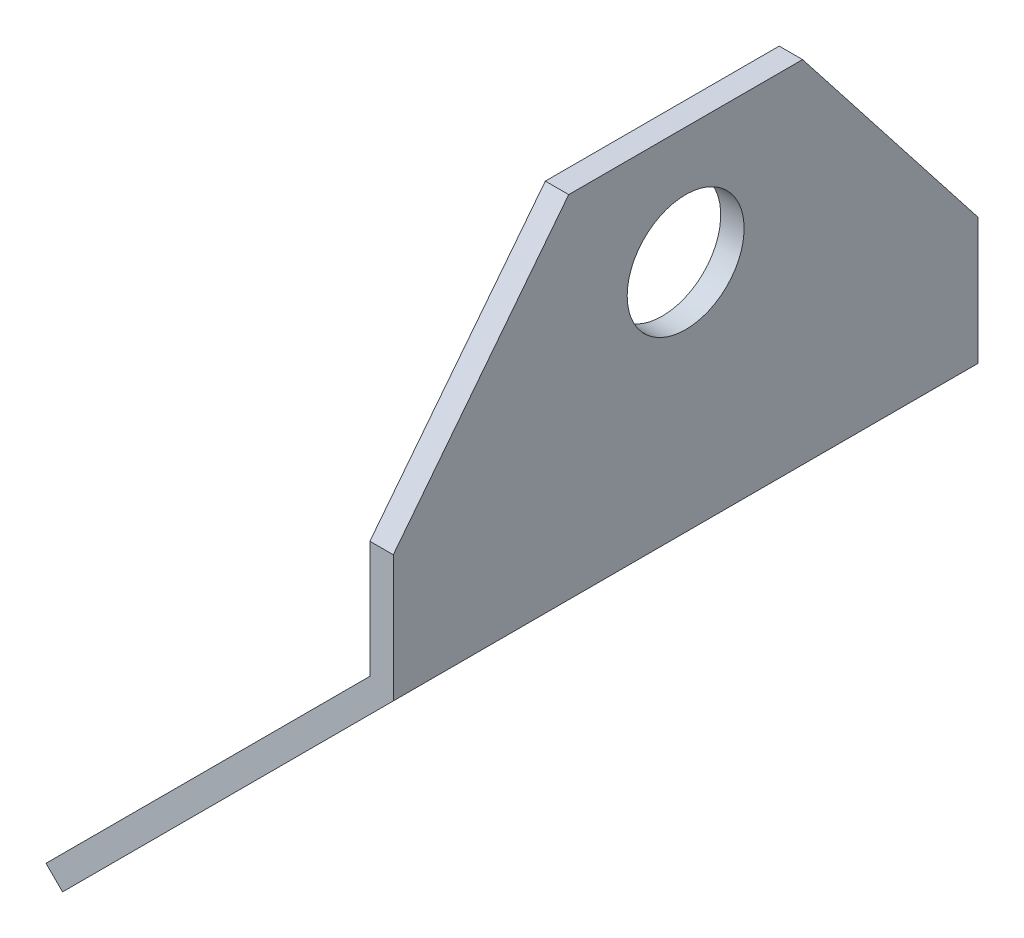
ISO-10303-21;
HEADER;
FILE_DESCRIPTION(('STEP AP214'),'2;1');
FILE_NAME('part.step','',(''),(''),'','','');
FILE_SCHEMA(('AUTOMOTIVE_DESIGN { 1 0 10303 214 1 1 1 1 }'));
ENDSEC;
DATA;
#1=APPLICATION_CONTEXT('core data for automotive mechanical design processes');
#2=APPLICATION_PROTOCOL_DEFINITION('international standard','automotive_design',2000,#1);
#3=PRODUCT_CONTEXT('',#1,'mechanical');
#4=PRODUCT('Part','Part','',(#3));
#5=PRODUCT_RELATED_PRODUCT_CATEGORY('part','',(#4));
#6=PRODUCT_DEFINITION_FORMATION('','',#4);
#7=PRODUCT_DEFINITION_CONTEXT('part definition',#1,'design');
#8=PRODUCT_DEFINITION('design','',#6,#7);
#9=PRODUCT_DEFINITION_SHAPE('','',#8);
#10=(LENGTH_UNIT() NAMED_UNIT(*) SI_UNIT(.MILLI.,.METRE.));
#11=(NAMED_UNIT(*) PLANE_ANGLE_UNIT() SI_UNIT($,.RADIAN.));
#12=(NAMED_UNIT(*) SI_UNIT($,.STERADIAN.) SOLID_ANGLE_UNIT());
#13=UNCERTAINTY_MEASURE_WITH_UNIT(LENGTH_MEASURE(1.E-05),#10,'distance_accuracy_value','');
#14=(GEOMETRIC_REPRESENTATION_CONTEXT(3) GLOBAL_UNCERTAINTY_ASSIGNED_CONTEXT((#13)) GLOBAL_UNIT_ASSIGNED_CONTEXT((#10,
#11,#12)) REPRESENTATION_CONTEXT('',''));
#15=CARTESIAN_POINT('',(0.,0.,0.));
#16=DIRECTION('',(0.,0.,1.));
#17=DIRECTION('',(1.,0.,0.));
#18=AXIS2_PLACEMENT_3D('',#15,#16,#17);
#19=CARTESIAN_POINT('',(0.,0.,50.0000000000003));
#20=DIRECTION('',(1.,0.,0.));
#21=DIRECTION('',(0.,0.,-1.));
#22=AXIS2_PLACEMENT_3D('',#19,#20,#21);
#23=PLANE('',#22);
#24=CARTESIAN_POINT('',(0.,20.,25.0000000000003));
#25=DIRECTION('',(1.,0.,0.));
#26=DIRECTION('',(0.,0.,-1.));
#27=AXIS2_PLACEMENT_3D('',#24,#25,#26);
#28=CIRCLE('',#27,5.);
#29=CARTESIAN_POINT('',(0.,20.,30.0000000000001));
#30=VERTEX_POINT('',#29);
#31=EDGE_CURVE('E179',#30,#30,#28,.T.);
#32=ORIENTED_EDGE('',*,*,#31,.F.);
#33=EDGE_LOOP('',(#32));
#34=FACE_BOUND('',#33,.T.);
#35=DIRECTION('',(0.,-1.,0.));
#36=VECTOR('',#35,1.);
#37=CARTESIAN_POINT('',(0.,0.,0.));
#38=LINE('',#37,#36);
#39=CARTESIAN_POINT('',(0.,10.8284271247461,1.94289029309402E-13));
#40=VERTEX_POINT('',#39);
#41=CARTESIAN_POINT('',(0.,0.,0.));
#42=VERTEX_POINT('',#41);
#43=EDGE_CURVE('E155',#40,#42,#38,.T.);
#44=ORIENTED_EDGE('',*,*,#43,.F.);
#45=DIRECTION('',(0.,-0.787581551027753,-0.616210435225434));
#46=VECTOR('',#45,1.);
#47=CARTESIAN_POINT('',(0.,29.9999999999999,15.0000000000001));
#48=LINE('',#47,#46);
#49=CARTESIAN_POINT('',(0.,29.9999999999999,15.0000000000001));
#50=VERTEX_POINT('',#49);
#51=EDGE_CURVE('E62',#50,#40,#48,.T.);
#52=ORIENTED_EDGE('',*,*,#51,.F.);
#53=DIRECTION('',(0.,0.,-1.));
#54=VECTOR('',#53,1.);
#55=CARTESIAN_POINT('',(0.,29.9999999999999,50.0000000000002));
#56=LINE('',#55,#54);
#57=CARTESIAN_POINT('',(0.,29.9999999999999,35.0000000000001));
#58=VERTEX_POINT('',#57);
#59=EDGE_CURVE('E117',#58,#50,#56,.T.);
#60=ORIENTED_EDGE('',*,*,#59,.F.);
#61=DIRECTION('',(0.,-0.787581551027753,0.616210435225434));
#62=VECTOR('',#61,1.);
#63=CARTESIAN_POINT('',(0.,29.9999999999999,35.0000000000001));
#64=LINE('',#63,#62);
#65=CARTESIAN_POINT('',(0.,10.8284271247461,50.0000000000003));
#66=VERTEX_POINT('',#65);
#67=EDGE_CURVE('E178',#58,#66,#64,.T.);
#68=ORIENTED_EDGE('',*,*,#67,.T.);
#69=DIRECTION('',(0.,-1.,0.));
#70=VECTOR('',#69,1.);
#71=CARTESIAN_POINT('',(0.,0.,50.0000000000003));
#72=LINE('',#71,#70);
#73=CARTESIAN_POINT('',(0.,0.,50.0000000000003));
#74=VERTEX_POINT('',#73);
#75=EDGE_CURVE('E171',#66,#74,#72,.T.);
#76=ORIENTED_EDGE('',*,*,#75,.T.);
#77=DIRECTION('',(0.,0.,-1.));
#78=VECTOR('',#77,1.);
#79=CARTESIAN_POINT('',(0.,0.,50.0000000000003));
#80=LINE('',#79,#78);
#81=EDGE_CURVE('E123',#74,#42,#80,.T.);
#82=ORIENTED_EDGE('',*,*,#81,.T.);
#83=EDGE_LOOP('',(#44,#52,#60,#68,#76,#82));
#84=FACE_BOUND('',#83,.T.);
#85=ADVANCED_FACE('F39',(#34,#84),#23,.T.);
#86=CARTESIAN_POINT('',(-2.00000000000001,30.,50.0000000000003));
#87=DIRECTION('',(0.,1.,0.));
#88=DIRECTION('',(0.,0.,1.));
#89=AXIS2_PLACEMENT_3D('',#86,#87,#88);
#90=PLANE('',#89);
#91=ORIENTED_EDGE('',*,*,#59,.T.);
#92=DIRECTION('',(1.,0.,0.));
#93=VECTOR('',#92,1.);
#94=CARTESIAN_POINT('',(0.001000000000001,29.9999999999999,14.9999999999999));
#95=LINE('',#94,#93);
#96=CARTESIAN_POINT('',(-1.99999999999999,29.9999999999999,15.0000000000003));
#97=VERTEX_POINT('',#96);
#98=EDGE_CURVE('E104',#97,#50,#95,.T.);
#99=ORIENTED_EDGE('',*,*,#98,.F.);
#100=DIRECTION('',(0.,0.,-1.));
#101=VECTOR('',#100,1.);
#102=CARTESIAN_POINT('',(-2.00000000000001,30.,50.0000000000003));
#103=LINE('',#102,#101);
#104=CARTESIAN_POINT('',(-2.,29.9999999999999,35.0000000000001));
#105=VERTEX_POINT('',#104);
#106=EDGE_CURVE('E115',#105,#97,#103,.T.);
#107=ORIENTED_EDGE('',*,*,#106,.F.);
#108=DIRECTION('',(1.,0.,0.));
#109=VECTOR('',#108,1.);
#110=CARTESIAN_POINT('',(0.00100000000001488,29.9999999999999,35.0000000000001));
#111=LINE('',#110,#109);
#112=EDGE_CURVE('E180',#105,#58,#111,.T.);
#113=ORIENTED_EDGE('',*,*,#112,.T.);
#114=EDGE_LOOP('',(#91,#99,#107,#113));
#115=FACE_BOUND('',#114,.T.);
#116=ADVANCED_FACE('F113',(#115),#90,.T.);
#117=CARTESIAN_POINT('',(-1.99999999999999,0.,50.0000000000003));
#118=DIRECTION('',(1.,0.,0.));
#119=DIRECTION('',(0.,0.,-1.));
#120=AXIS2_PLACEMENT_3D('',#117,#118,#119);
#121=PLANE('',#120);
#122=CARTESIAN_POINT('',(-1.99999999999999,20.,25.0000000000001));
#123=DIRECTION('',(-1.,0.,0.));
#124=DIRECTION('',(0.,0.,1.));
#125=AXIS2_PLACEMENT_3D('',#122,#123,#124);
#126=CIRCLE('',#125,5.);
#127=CARTESIAN_POINT('',(-1.99999999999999,20.,30.0000000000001));
#128=VERTEX_POINT('',#127);
#129=EDGE_CURVE('E224',#128,#128,#126,.T.);
#130=ORIENTED_EDGE('',*,*,#129,.F.);
#131=EDGE_LOOP('',(#130));
#132=FACE_BOUND('',#131,.T.);
#133=DIRECTION('',(0.,-0.787581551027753,-0.616210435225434));
#134=VECTOR('',#133,1.);
#135=CARTESIAN_POINT('',(-1.99999999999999,29.9999999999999,15.0000000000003));
#136=LINE('',#135,#134);
#137=CARTESIAN_POINT('',(-2.,10.8284271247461,0.));
#138=VERTEX_POINT('',#137);
#139=EDGE_CURVE('E101',#97,#138,#136,.T.);
#140=ORIENTED_EDGE('',*,*,#139,.T.);
#141=DIRECTION('',(0.,1.,0.));
#142=VECTOR('',#141,1.);
#143=CARTESIAN_POINT('',(-1.99999999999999,0.,1.94289029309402E-13));
#144=LINE('',#143,#142);
#145=CARTESIAN_POINT('',(-1.99999999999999,0.828427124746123,2.22044604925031E-13));
#146=VERTEX_POINT('',#145);
#147=EDGE_CURVE('E157',#138,#146,#144,.F.);
#148=ORIENTED_EDGE('',*,*,#147,.T.);
#149=DIRECTION('',(0.,0.,-1.));
#150=VECTOR('',#149,1.);
#151=CARTESIAN_POINT('',(-2.00000000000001,0.828427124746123,50.0000000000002));
#152=LINE('',#151,#150);
#153=CARTESIAN_POINT('',(-2.00000000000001,0.828427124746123,50.0000000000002));
#154=VERTEX_POINT('',#153);
#155=EDGE_CURVE('E121',#154,#146,#152,.T.);
#156=ORIENTED_EDGE('',*,*,#155,.F.);
#157=DIRECTION('',(0.,1.,0.));
#158=VECTOR('',#157,1.);
#159=CARTESIAN_POINT('',(-1.99999999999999,0.,50.0000000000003));
#160=LINE('',#159,#158);
#161=CARTESIAN_POINT('',(-1.99999999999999,10.8284271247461,50.));
#162=VERTEX_POINT('',#161);
#163=EDGE_CURVE('E126',#162,#154,#160,.F.);
#164=ORIENTED_EDGE('',*,*,#163,.F.);
#165=DIRECTION('',(0.,-0.787581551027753,0.616210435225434));
#166=VECTOR('',#165,1.);
#167=CARTESIAN_POINT('',(-2.,29.9999999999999,35.0000000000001));
#168=LINE('',#167,#166);
#169=EDGE_CURVE('E54',#105,#162,#168,.T.);
#170=ORIENTED_EDGE('',*,*,#169,.F.);
#171=ORIENTED_EDGE('',*,*,#106,.T.);
#172=EDGE_LOOP('',(#140,#148,#156,#164,#170,#171));
#173=FACE_BOUND('',#172,.T.);
#174=ADVANCED_FACE('F119',(#132,#173),#121,.F.);
#175=CARTESIAN_POINT('',(0.,0.,0.));
#176=DIRECTION('',(0.,0.,-1.));
#177=DIRECTION('',(-1.,0.,0.));
#178=AXIS2_PLACEMENT_3D('',#175,#176,#177);
#179=PLANE('',#178);
#180=ORIENTED_EDGE('',*,*,#147,.F.);
#181=DIRECTION('',(-1.,0.,0.));
#182=VECTOR('',#181,1.);
#183=CARTESIAN_POINT('',(0.001000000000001,10.8284271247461,0.));
#184=LINE('',#183,#182);
#185=EDGE_CURVE('E105',#40,#138,#184,.T.);
#186=ORIENTED_EDGE('',*,*,#185,.F.);
#187=ORIENTED_EDGE('',*,*,#43,.T.);
#188=DIRECTION('',(-0.707106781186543,-0.707106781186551,0.));
#189=VECTOR('',#188,1.);
#190=CARTESIAN_POINT('',(0.,0.,0.));
#191=LINE('',#190,#189);
#192=CARTESIAN_POINT('',(-28.2842712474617,-28.2842712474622,1.94289029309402E-13));
#193=VERTEX_POINT('',#192);
#194=EDGE_CURVE('E138',#42,#193,#191,.T.);
#195=ORIENTED_EDGE('',*,*,#194,.T.);
#196=DIRECTION('',(-0.707106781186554,0.707106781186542,0.));
#197=VECTOR('',#196,1.);
#198=CARTESIAN_POINT('',(-28.2842712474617,-28.2842712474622,1.94289029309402E-13));
#199=LINE('',#198,#197);
#200=CARTESIAN_POINT('',(-29.6984848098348,-26.870057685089,1.94289029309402E-13));
#201=VERTEX_POINT('',#200);
#202=EDGE_CURVE('E145',#193,#201,#199,.T.);
#203=ORIENTED_EDGE('',*,*,#202,.T.);
#204=DIRECTION('',(-0.707106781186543,-0.707106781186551,0.));
#205=VECTOR('',#204,1.);
#206=CARTESIAN_POINT('',(-1.41421356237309,1.41421356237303,1.94289029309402E-13));
#207=LINE('',#206,#205);
#208=EDGE_CURVE('E151',#146,#201,#207,.T.);
#209=ORIENTED_EDGE('',*,*,#208,.F.);
#210=EDGE_LOOP('',(#180,#186,#187,#195,#203,#209));
#211=FACE_BOUND('',#210,.T.);
#212=ADVANCED_FACE('F153',(#211),#179,.T.);
#213=CARTESIAN_POINT('',(-1.4142135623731,1.41421356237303,50.));
#214=DIRECTION('',(0.707106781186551,-0.707106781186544,0.));
#215=DIRECTION('',(0.707106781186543,0.707106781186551,0.));
#216=AXIS2_PLACEMENT_3D('',#213,#214,#215);
#217=PLANE('',#216);
#218=CARTESIAN_POINT('',(-15.556349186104,-12.727922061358,12.5400000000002));
#219=DIRECTION('',(-0.707106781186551,0.707106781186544,0.));
#220=DIRECTION('',(-0.707106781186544,-0.707106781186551,0.));
#221=AXIS2_PLACEMENT_3D('',#218,#219,#220);
#222=CIRCLE('',#221,4.);
#223=CARTESIAN_POINT('',(-18.3847763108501,-15.5563491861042,12.5400000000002));
#224=VERTEX_POINT('',#223);
#225=EDGE_CURVE('E227',#224,#224,#222,.T.);
#226=ORIENTED_EDGE('',*,*,#225,.F.);
#227=EDGE_LOOP('',(#226));
#228=FACE_BOUND('',#227,.T.);
#229=CARTESIAN_POINT('',(-15.556349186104,-12.727922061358,37.4600000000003));
#230=DIRECTION('',(-0.707106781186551,0.707106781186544,0.));
#231=DIRECTION('',(-0.707106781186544,-0.707106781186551,0.));
#232=AXIS2_PLACEMENT_3D('',#229,#230,#231);
#233=CIRCLE('',#232,4.);
#234=CARTESIAN_POINT('',(-18.3847763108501,-15.5563491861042,37.4600000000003));
#235=VERTEX_POINT('',#234);
#236=EDGE_CURVE('E218',#235,#235,#233,.T.);
#237=ORIENTED_EDGE('',*,*,#236,.F.);
#238=EDGE_LOOP('',(#237));
#239=FACE_BOUND('',#238,.T.);
#240=ORIENTED_EDGE('',*,*,#208,.T.);
#241=DIRECTION('',(0.,0.,-1.));
#242=VECTOR('',#241,1.);
#243=CARTESIAN_POINT('',(-29.6984848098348,-26.870057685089,50.0000000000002));
#244=LINE('',#243,#242);
#245=CARTESIAN_POINT('',(-29.6984848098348,-26.870057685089,50.0000000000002));
#246=VERTEX_POINT('',#245);
#247=EDGE_CURVE('E11',#246,#201,#244,.T.);
#248=ORIENTED_EDGE('',*,*,#247,.F.);
#249=DIRECTION('',(-0.707106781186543,-0.707106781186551,0.));
#250=VECTOR('',#249,1.);
#251=CARTESIAN_POINT('',(-1.4142135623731,1.41421356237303,50.));
#252=LINE('',#251,#250);
#253=EDGE_CURVE('E160',#154,#246,#252,.T.);
#254=ORIENTED_EDGE('',*,*,#253,.F.);
#255=ORIENTED_EDGE('',*,*,#155,.T.);
#256=EDGE_LOOP('',(#240,#248,#254,#255));
#257=FACE_BOUND('',#256,.T.);
#258=ADVANCED_FACE('F41',(#228,#239,#257),#217,.F.);
#259=CARTESIAN_POINT('',(-28.2842712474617,-28.2842712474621,50.));
#260=DIRECTION('',(-0.707106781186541,-0.707106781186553,0.));
#261=DIRECTION('',(0.707106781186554,-0.707106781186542,0.));
#262=AXIS2_PLACEMENT_3D('',#259,#260,#261);
#263=PLANE('',#262);
#264=ORIENTED_EDGE('',*,*,#202,.F.);
#265=DIRECTION('',(0.,0.,-1.));
#266=VECTOR('',#265,1.);
#267=CARTESIAN_POINT('',(-28.2842712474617,-28.2842712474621,50.));
#268=LINE('',#267,#266);
#269=CARTESIAN_POINT('',(-28.2842712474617,-28.2842712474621,50.));
#270=VERTEX_POINT('',#269);
#271=EDGE_CURVE('E47',#270,#193,#268,.T.);
#272=ORIENTED_EDGE('',*,*,#271,.F.);
#273=DIRECTION('',(-0.707106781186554,0.707106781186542,0.));
#274=VECTOR('',#273,1.);
#275=CARTESIAN_POINT('',(-28.2842712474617,-28.2842712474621,50.));
#276=LINE('',#275,#274);
#277=EDGE_CURVE('E162',#270,#246,#276,.T.);
#278=ORIENTED_EDGE('',*,*,#277,.T.);
#279=ORIENTED_EDGE('',*,*,#247,.T.);
#280=EDGE_LOOP('',(#264,#272,#278,#279));
#281=FACE_BOUND('',#280,.T.);
#282=ADVANCED_FACE('F146',(#281),#263,.T.);
#283=CARTESIAN_POINT('',(0.,0.,50.0000000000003));
#284=DIRECTION('',(0.707106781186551,-0.707106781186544,0.));
#285=DIRECTION('',(0.707106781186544,0.707106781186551,0.));
#286=AXIS2_PLACEMENT_3D('',#283,#284,#285);
#287=PLANE('',#286);
#288=CARTESIAN_POINT('',(-14.1421356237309,-14.1421356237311,12.54));
#289=DIRECTION('',(0.707106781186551,-0.707106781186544,0.));
#290=DIRECTION('',(0.707106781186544,0.707106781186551,0.));
#291=AXIS2_PLACEMENT_3D('',#288,#289,#290);
#292=CIRCLE('',#291,4.);
#293=CARTESIAN_POINT('',(-11.3137084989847,-11.3137084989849,12.54));
#294=VERTEX_POINT('',#293);
#295=EDGE_CURVE('E213',#294,#294,#292,.F.);
#296=ORIENTED_EDGE('',*,*,#295,.T.);
#297=EDGE_LOOP('',(#296));
#298=FACE_BOUND('',#297,.T.);
#299=CARTESIAN_POINT('',(-14.1421356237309,-14.142135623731,37.4600000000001));
#300=DIRECTION('',(0.707106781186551,-0.707106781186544,0.));
#301=DIRECTION('',(0.707106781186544,0.707106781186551,0.));
#302=AXIS2_PLACEMENT_3D('',#299,#300,#301);
#303=CIRCLE('',#302,4.);
#304=CARTESIAN_POINT('',(-11.3137084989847,-11.3137084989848,37.4600000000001));
#305=VERTEX_POINT('',#304);
#306=EDGE_CURVE('E216',#305,#305,#303,.F.);
#307=ORIENTED_EDGE('',*,*,#306,.T.);
#308=EDGE_LOOP('',(#307));
#309=FACE_BOUND('',#308,.T.);
#310=ORIENTED_EDGE('',*,*,#194,.F.);
#311=ORIENTED_EDGE('',*,*,#81,.F.);
#312=DIRECTION('',(-0.707106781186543,-0.707106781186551,0.));
#313=VECTOR('',#312,1.);
#314=CARTESIAN_POINT('',(0.,0.,50.0000000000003));
#315=LINE('',#314,#313);
#316=EDGE_CURVE('E140',#74,#270,#315,.T.);
#317=ORIENTED_EDGE('',*,*,#316,.T.);
#318=ORIENTED_EDGE('',*,*,#271,.T.);
#319=EDGE_LOOP('',(#310,#311,#317,#318));
#320=FACE_BOUND('',#319,.T.);
#321=ADVANCED_FACE('F135',(#298,#309,#320),#287,.T.);
#322=CARTESIAN_POINT('',(0.,0.,50.0000000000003));
#323=DIRECTION('',(0.,0.,-1.));
#324=DIRECTION('',(-1.,0.,0.));
#325=AXIS2_PLACEMENT_3D('',#322,#323,#324);
#326=PLANE('',#325);
#327=ORIENTED_EDGE('',*,*,#75,.F.);
#328=DIRECTION('',(1.,0.,0.));
#329=VECTOR('',#328,1.);
#330=CARTESIAN_POINT('',(0.001000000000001,10.8284271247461,50.));
#331=LINE('',#330,#329);
#332=EDGE_CURVE('E176',#162,#66,#331,.T.);
#333=ORIENTED_EDGE('',*,*,#332,.F.);
#334=ORIENTED_EDGE('',*,*,#163,.T.);
#335=ORIENTED_EDGE('',*,*,#253,.T.);
#336=ORIENTED_EDGE('',*,*,#277,.F.);
#337=ORIENTED_EDGE('',*,*,#316,.F.);
#338=EDGE_LOOP('',(#327,#333,#334,#335,#336,#337));
#339=FACE_BOUND('',#338,.T.);
#340=ADVANCED_FACE('F184',(#339),#326,.F.);
#341=CARTESIAN_POINT('',(0.001000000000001,29.9999999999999,14.9999999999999));
#342=DIRECTION('',(0.,0.616210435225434,-0.787581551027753));
#343=DIRECTION('',(0.,0.787581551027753,0.616210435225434));
#344=AXIS2_PLACEMENT_3D('',#341,#342,#343);
#345=PLANE('',#344);
#346=ORIENTED_EDGE('',*,*,#51,.T.);
#347=ORIENTED_EDGE('',*,*,#185,.T.);
#348=ORIENTED_EDGE('',*,*,#139,.F.);
#349=ORIENTED_EDGE('',*,*,#98,.T.);
#350=EDGE_LOOP('',(#346,#347,#348,#349));
#351=FACE_BOUND('',#350,.T.);
#352=ADVANCED_FACE('F103',(#351),#345,.T.);
#353=CARTESIAN_POINT('',(0.00100000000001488,29.9999999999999,35.0000000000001));
#354=DIRECTION('',(0.,-0.616210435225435,-0.787581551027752));
#355=DIRECTION('',(0.,0.787581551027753,-0.616210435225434));
#356=AXIS2_PLACEMENT_3D('',#353,#354,#355);
#357=PLANE('',#356);
#358=ORIENTED_EDGE('',*,*,#112,.F.);
#359=ORIENTED_EDGE('',*,*,#169,.T.);
#360=ORIENTED_EDGE('',*,*,#332,.T.);
#361=ORIENTED_EDGE('',*,*,#67,.F.);
#362=EDGE_LOOP('',(#358,#359,#360,#361));
#363=FACE_BOUND('',#362,.T.);
#364=ADVANCED_FACE('F234',(#363),#357,.F.);
#365=CARTESIAN_POINT('',(-1.99999999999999,20.,25.0000000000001));
#366=DIRECTION('',(-1.,0.,0.));
#367=DIRECTION('',(0.,0.,1.));
#368=AXIS2_PLACEMENT_3D('',#365,#366,#367);
#369=CYLINDRICAL_SURFACE('',#368,5.);
#370=CARTESIAN_POINT('',(-1.99999999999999,20.,30.0000000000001));
#371=CARTESIAN_POINT('',(-1.97916666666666,20.,30.0000000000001));
#372=CARTESIAN_POINT('',(-1.95833333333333,20.,30.0000000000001));
#373=CARTESIAN_POINT('',(-1.91666666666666,20.,30.0000000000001));
#374=CARTESIAN_POINT('',(-1.89583333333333,20.,30.0000000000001));
#375=CARTESIAN_POINT('',(-1.85416666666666,20.,30.0000000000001));
#376=CARTESIAN_POINT('',(-1.83333333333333,20.,30.0000000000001));
#377=CARTESIAN_POINT('',(-1.79166666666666,20.,30.0000000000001));
#378=CARTESIAN_POINT('',(-1.77083333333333,20.,30.0000000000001));
#379=CARTESIAN_POINT('',(-1.72916666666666,20.,30.0000000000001));
#380=CARTESIAN_POINT('',(-1.70833333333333,20.,30.0000000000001));
#381=CARTESIAN_POINT('',(-1.66666666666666,20.,30.0000000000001));
#382=CARTESIAN_POINT('',(-1.64583333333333,20.,30.0000000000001));
#383=CARTESIAN_POINT('',(-1.60416666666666,20.,30.0000000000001));
#384=CARTESIAN_POINT('',(-1.58333333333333,20.,30.0000000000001));
#385=CARTESIAN_POINT('',(-1.54166666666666,20.,30.0000000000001));
#386=CARTESIAN_POINT('',(-1.52083333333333,20.,30.0000000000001));
#387=CARTESIAN_POINT('',(-1.47916666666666,20.,30.0000000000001));
#388=CARTESIAN_POINT('',(-1.45833333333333,20.,30.0000000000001));
#389=CARTESIAN_POINT('',(-1.41666666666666,20.,30.0000000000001));
#390=CARTESIAN_POINT('',(-1.39583333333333,20.,30.0000000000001));
#391=CARTESIAN_POINT('',(-1.35416666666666,20.,30.0000000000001));
#392=CARTESIAN_POINT('',(-1.33333333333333,20.,30.0000000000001));
#393=CARTESIAN_POINT('',(-1.29166666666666,20.,30.0000000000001));
#394=CARTESIAN_POINT('',(-1.27083333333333,20.,30.0000000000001));
#395=CARTESIAN_POINT('',(-1.22916666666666,20.,30.0000000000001));
#396=CARTESIAN_POINT('',(-1.20833333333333,20.,30.0000000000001));
#397=CARTESIAN_POINT('',(-1.16666666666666,20.,30.0000000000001));
#398=CARTESIAN_POINT('',(-1.14583333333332,20.,30.0000000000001));
#399=CARTESIAN_POINT('',(-1.10416666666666,20.,30.0000000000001));
#400=CARTESIAN_POINT('',(-1.08333333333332,20.,30.0000000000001));
#401=CARTESIAN_POINT('',(-1.04166666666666,20.,30.0000000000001));
#402=CARTESIAN_POINT('',(-1.02083333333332,20.,30.0000000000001));
#403=CARTESIAN_POINT('',(-0.979166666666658,20.,30.0000000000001));
#404=CARTESIAN_POINT('',(-0.958333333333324,20.,30.0000000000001));
#405=CARTESIAN_POINT('',(-0.916666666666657,20.,30.0000000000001));
#406=CARTESIAN_POINT('',(-0.895833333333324,20.,30.0000000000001));
#407=CARTESIAN_POINT('',(-0.854166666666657,20.,30.0000000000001));
#408=CARTESIAN_POINT('',(-0.833333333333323,20.,30.0000000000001));
#409=CARTESIAN_POINT('',(-0.791666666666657,20.,30.0000000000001));
#410=CARTESIAN_POINT('',(-0.770833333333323,20.,30.0000000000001));
#411=CARTESIAN_POINT('',(-0.729166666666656,20.,30.0000000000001));
#412=CARTESIAN_POINT('',(-0.708333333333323,20.,30.0000000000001));
#413=CARTESIAN_POINT('',(-0.666666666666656,20.,30.0000000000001));
#414=CARTESIAN_POINT('',(-0.645833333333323,20.,30.0000000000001));
#415=CARTESIAN_POINT('',(-0.604166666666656,20.,30.0000000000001));
#416=CARTESIAN_POINT('',(-0.583333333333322,20.,30.0000000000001));
#417=CARTESIAN_POINT('',(-0.541666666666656,20.,30.0000000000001));
#418=CARTESIAN_POINT('',(-0.520833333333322,20.,30.0000000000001));
#419=CARTESIAN_POINT('',(-0.479166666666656,20.,30.0000000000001));
#420=CARTESIAN_POINT('',(-0.458333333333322,20.,30.0000000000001));
#421=CARTESIAN_POINT('',(-0.416666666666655,20.,30.0000000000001));
#422=CARTESIAN_POINT('',(-0.395833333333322,20.,30.0000000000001));
#423=CARTESIAN_POINT('',(-0.354166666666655,20.,30.0000000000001));
#424=CARTESIAN_POINT('',(-0.333333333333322,20.,30.0000000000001));
#425=CARTESIAN_POINT('',(-0.291666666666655,20.,30.0000000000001));
#426=CARTESIAN_POINT('',(-0.270833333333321,20.,30.0000000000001));
#427=CARTESIAN_POINT('',(-0.229166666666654,20.,30.0000000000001));
#428=CARTESIAN_POINT('',(-0.208333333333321,20.,30.0000000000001));
#429=CARTESIAN_POINT('',(-0.166666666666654,20.,30.0000000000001));
#430=CARTESIAN_POINT('',(-0.145833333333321,20.,30.0000000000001));
#431=CARTESIAN_POINT('',(-0.104166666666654,20.,30.0000000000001));
#432=CARTESIAN_POINT('',(-0.0833333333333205,20.,30.0000000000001));
#433=CARTESIAN_POINT('',(-0.0416666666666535,20.,30.0000000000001));
#434=CARTESIAN_POINT('',(-0.02083333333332,20.,30.0000000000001));
#435=CARTESIAN_POINT('',(0.,20.,30.0000000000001));
#436=B_SPLINE_CURVE_WITH_KNOTS('',3,(#370,#371,#372,#373,#374,#375,#376,#377,#378,#379,#380,
#381,#382,#383,#384,#385,#386,#387,#388,#389,#390,#391,#392,#393,#394,#395,#396,#397,#398,#399,
#400,#401,#402,#403,#404,#405,#406,#407,#408,#409,#410,#411,#412,#413,#414,#415,#416,#417,#418,
#419,#420,#421,#422,#423,#424,#425,#426,#427,#428,#429,#430,#431,#432,#433,#434,#435),
.UNSPECIFIED.,.F.,.F.,(4,2,2,2,2,2,2,2,2,2,2,2,2,2,2,2,2,2,2,2,2,2,2,2,2,2,2,2,2,2,2,2,4),(0.,
0.0625000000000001,0.125,0.187500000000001,0.250000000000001,0.312500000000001,
0.375000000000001,0.437500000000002,0.500000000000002,0.562500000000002,0.625000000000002,
0.687500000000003,0.750000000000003,0.812500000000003,0.875000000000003,0.937500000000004,1.,
1.0625,1.125,1.1875,1.25000000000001,1.31250000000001,1.37500000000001,1.43750000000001,
1.50000000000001,1.56250000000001,1.62500000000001,1.68750000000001,1.75000000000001,
1.81250000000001,1.87500000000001,1.93750000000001,2.00000000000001),.UNSPECIFIED.);
#437=EDGE_CURVE('BSEAM231',#128,#30,#436,.T.);
#438=ORIENTED_EDGE('',*,*,#129,.T.);
#439=ORIENTED_EDGE('',*,*,#31,.T.);
#440=ORIENTED_EDGE('',*,*,#437,.T.);
#441=ORIENTED_EDGE('',*,*,#437,.F.);
#442=EDGE_LOOP('',(#438,#440,#439,#441));
#443=FACE_BOUND('',#442,.T.);
#444=ADVANCED_FACE('F231',(#443),#369,.F.);
#445=CARTESIAN_POINT('',(0.00100000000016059,-28.285271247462,37.46));
#446=DIRECTION('',(-0.707106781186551,0.707106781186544,0.));
#447=DIRECTION('',(-0.707106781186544,-0.707106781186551,0.));
#448=AXIS2_PLACEMENT_3D('',#445,#446,#447);
#449=CYLINDRICAL_SURFACE('',#448,4.);
#450=ORIENTED_EDGE('',*,*,#306,.F.);
#451=EDGE_LOOP('',(#450));
#452=FACE_BOUND('',#451,.T.);
#453=ORIENTED_EDGE('',*,*,#236,.T.);
#454=EDGE_LOOP('',(#453));
#455=FACE_BOUND('',#454,.T.);
#456=ADVANCED_FACE('F233',(#452,#455),#449,.F.);
#457=CARTESIAN_POINT('',(0.00100000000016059,-28.2852712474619,12.54));
#458=DIRECTION('',(-0.707106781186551,0.707106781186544,0.));
#459=DIRECTION('',(-0.707106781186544,-0.707106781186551,0.));
#460=AXIS2_PLACEMENT_3D('',#457,#458,#459);
#461=CYLINDRICAL_SURFACE('',#460,4.);
#462=ORIENTED_EDGE('',*,*,#295,.F.);
#463=EDGE_LOOP('',(#462));
#464=FACE_BOUND('',#463,.T.);
#465=ORIENTED_EDGE('',*,*,#225,.T.);
#466=EDGE_LOOP('',(#465));
#467=FACE_BOUND('',#466,.T.);
#468=ADVANCED_FACE('F241',(#464,#467),#461,.F.);
#469=CLOSED_SHELL('',(#85,#116,#174,#212,#258,#282,#321,#340,#352,#364,#444,#456,#468));
#470=MANIFOLD_SOLID_BREP('B2',#469);
#471=ADVANCED_BREP_SHAPE_REPRESENTATION('',(#18,#470),#14);
#472=SHAPE_DEFINITION_REPRESENTATION(#9,#471);
ENDSEC;
END-ISO-10303-21;
